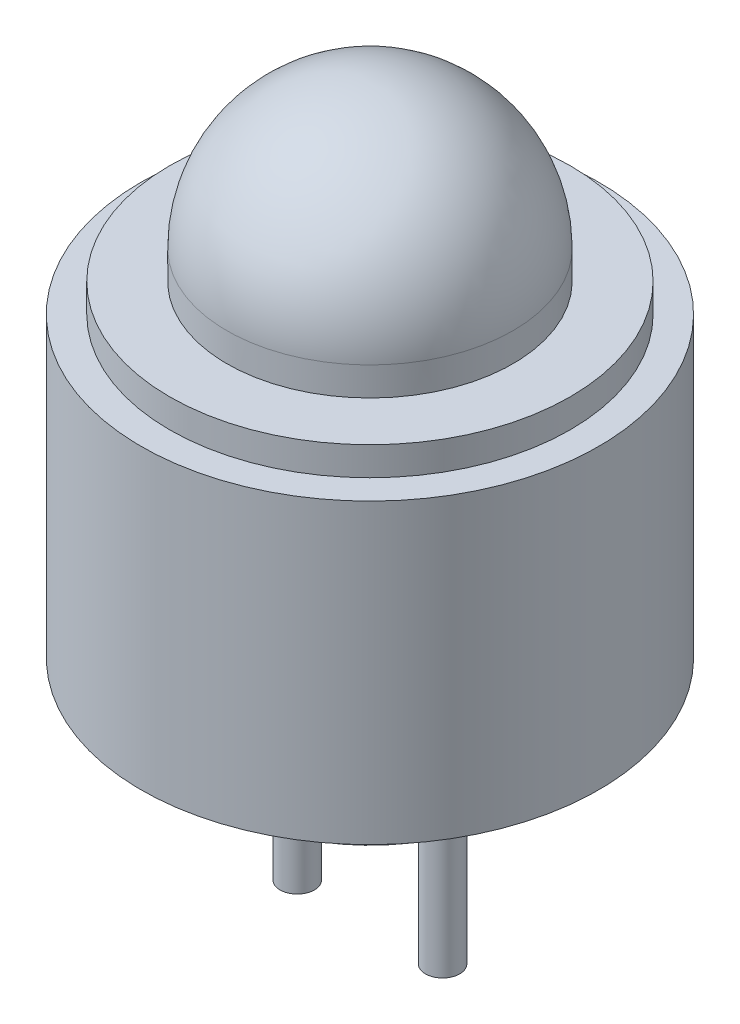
ISO-10303-21;
HEADER;
FILE_DESCRIPTION(('STEP AP214'),'2;1');
FILE_NAME('part.step','',(''),(''),'','','');
FILE_SCHEMA(('AUTOMOTIVE_DESIGN { 1 0 10303 214 1 1 1 1 }'));
ENDSEC;
DATA;
#1=APPLICATION_CONTEXT('core data for automotive mechanical design processes');
#2=APPLICATION_PROTOCOL_DEFINITION('international standard','automotive_design',2000,#1);
#3=PRODUCT_CONTEXT('',#1,'mechanical');
#4=PRODUCT('Part','Part','',(#3));
#5=PRODUCT_RELATED_PRODUCT_CATEGORY('part','',(#4));
#6=PRODUCT_DEFINITION_FORMATION('','',#4);
#7=PRODUCT_DEFINITION_CONTEXT('part definition',#1,'design');
#8=PRODUCT_DEFINITION('design','',#6,#7);
#9=PRODUCT_DEFINITION_SHAPE('','',#8);
#10=(LENGTH_UNIT() NAMED_UNIT(*) SI_UNIT(.MILLI.,.METRE.));
#11=(NAMED_UNIT(*) PLANE_ANGLE_UNIT() SI_UNIT($,.RADIAN.));
#12=(NAMED_UNIT(*) SI_UNIT($,.STERADIAN.) SOLID_ANGLE_UNIT());
#13=UNCERTAINTY_MEASURE_WITH_UNIT(LENGTH_MEASURE(1.E-05),#10,'distance_accuracy_value','');
#14=(GEOMETRIC_REPRESENTATION_CONTEXT(3) GLOBAL_UNCERTAINTY_ASSIGNED_CONTEXT((#13)) GLOBAL_UNIT_ASSIGNED_CONTEXT((#10,
#11,#12)) REPRESENTATION_CONTEXT('',''));
#15=CARTESIAN_POINT('',(0.,0.,0.));
#16=DIRECTION('',(0.,0.,1.));
#17=DIRECTION('',(1.,0.,0.));
#18=AXIS2_PLACEMENT_3D('',#15,#16,#17);
#19=CARTESIAN_POINT('',(0.,0.,0.));
#20=DIRECTION('',(0.,1.,0.));
#21=DIRECTION('',(-1.,0.,0.));
#22=AXIS2_PLACEMENT_3D('',#19,#20,#21);
#23=PLANE('',#22);
#24=CARTESIAN_POINT('',(-1.27,0.,0.));
#25=DIRECTION('',(0.,1.,0.));
#26=DIRECTION('',(-1.,0.,0.));
#27=AXIS2_PLACEMENT_3D('',#24,#25,#26);
#28=CIRCLE('',#27,0.3);
#29=CARTESIAN_POINT('',(-1.57,0.,0.));
#30=VERTEX_POINT('',#29);
#31=EDGE_CURVE('E38',#30,#30,#28,.F.);
#32=ORIENTED_EDGE('',*,*,#31,.F.);
#33=EDGE_LOOP('',(#32));
#34=FACE_BOUND('',#33,.T.);
#35=CARTESIAN_POINT('',(0.,0.,0.));
#36=DIRECTION('',(0.,1.,0.));
#37=DIRECTION('',(-1.,0.,0.));
#38=AXIS2_PLACEMENT_3D('',#35,#36,#37);
#39=CIRCLE('',#38,2.6);
#40=CARTESIAN_POINT('',(-2.6,0.,0.));
#41=VERTEX_POINT('',#40);
#42=EDGE_CURVE('E42',#41,#41,#39,.T.);
#43=ORIENTED_EDGE('',*,*,#42,.F.);
#44=EDGE_LOOP('',(#43));
#45=FACE_BOUND('',#44,.T.);
#46=CARTESIAN_POINT('',(1.27,0.,0.));
#47=DIRECTION('',(0.,1.,0.));
#48=DIRECTION('',(-1.,0.,0.));
#49=AXIS2_PLACEMENT_3D('',#46,#47,#48);
#50=CIRCLE('',#49,0.3);
#51=CARTESIAN_POINT('',(0.97,0.,0.));
#52=VERTEX_POINT('',#51);
#53=EDGE_CURVE('E10',#52,#52,#50,.F.);
#54=ORIENTED_EDGE('',*,*,#53,.F.);
#55=EDGE_LOOP('',(#54));
#56=FACE_BOUND('',#55,.T.);
#57=ADVANCED_FACE('F32',(#34,#45,#56),#23,.F.);
#58=CARTESIAN_POINT('',(0.,9.7,0.));
#59=DIRECTION('',(0.,1.,0.));
#60=DIRECTION('',(-1.,0.,0.));
#61=AXIS2_PLACEMENT_3D('',#58,#59,#60);
#62=CYLINDRICAL_SURFACE('',#61,2.6);
#63=CARTESIAN_POINT('',(0.,1.,0.));
#64=DIRECTION('',(0.,1.,0.));
#65=DIRECTION('',(-1.,0.,0.));
#66=AXIS2_PLACEMENT_3D('',#63,#64,#65);
#67=CIRCLE('',#66,2.6);
#68=CARTESIAN_POINT('',(-2.6,1.,0.));
#69=VERTEX_POINT('',#68);
#70=EDGE_CURVE('E46',#69,#69,#67,.T.);
#71=ORIENTED_EDGE('',*,*,#70,.F.);
#72=EDGE_LOOP('',(#71));
#73=FACE_BOUND('',#72,.T.);
#74=ORIENTED_EDGE('',*,*,#42,.T.);
#75=EDGE_LOOP('',(#74));
#76=FACE_BOUND('',#75,.T.);
#77=ADVANCED_FACE('F91',(#73,#76),#62,.T.);
#78=CARTESIAN_POINT('',(2.6,1.,0.));
#79=DIRECTION('',(0.,1.,0.));
#80=DIRECTION('',(-1.,0.,0.));
#81=AXIS2_PLACEMENT_3D('',#78,#79,#80);
#82=PLANE('',#81);
#83=CARTESIAN_POINT('',(0.,1.,0.));
#84=DIRECTION('',(0.,1.,0.));
#85=DIRECTION('',(-1.,0.,0.));
#86=AXIS2_PLACEMENT_3D('',#83,#84,#85);
#87=CIRCLE('',#86,4.);
#88=CARTESIAN_POINT('',(-4.,1.,0.));
#89=VERTEX_POINT('',#88);
#90=EDGE_CURVE('E51',#89,#89,#87,.T.);
#91=ORIENTED_EDGE('',*,*,#90,.F.);
#92=EDGE_LOOP('',(#91));
#93=FACE_BOUND('',#92,.T.);
#94=ORIENTED_EDGE('',*,*,#70,.T.);
#95=EDGE_LOOP('',(#94));
#96=FACE_BOUND('',#95,.T.);
#97=ADVANCED_FACE('F96',(#93,#96),#82,.F.);
#98=CARTESIAN_POINT('',(0.,9.7,0.));
#99=DIRECTION('',(0.,1.,0.));
#100=DIRECTION('',(-1.,0.,0.));
#101=AXIS2_PLACEMENT_3D('',#98,#99,#100);
#102=CYLINDRICAL_SURFACE('',#101,4.);
#103=CARTESIAN_POINT('',(0.,6.2,0.));
#104=DIRECTION('',(0.,1.,0.));
#105=DIRECTION('',(-1.,0.,0.));
#106=AXIS2_PLACEMENT_3D('',#103,#104,#105);
#107=CIRCLE('',#106,4.);
#108=CARTESIAN_POINT('',(-4.,6.2,0.));
#109=VERTEX_POINT('',#108);
#110=EDGE_CURVE('E54',#109,#109,#107,.T.);
#111=ORIENTED_EDGE('',*,*,#110,.F.);
#112=EDGE_LOOP('',(#111));
#113=FACE_BOUND('',#112,.T.);
#114=ORIENTED_EDGE('',*,*,#90,.T.);
#115=EDGE_LOOP('',(#114));
#116=FACE_BOUND('',#115,.T.);
#117=ADVANCED_FACE('F105',(#113,#116),#102,.T.);
#118=CARTESIAN_POINT('',(4.,6.2,0.));
#119=DIRECTION('',(0.,-1.,0.));
#120=DIRECTION('',(1.,0.,0.));
#121=AXIS2_PLACEMENT_3D('',#118,#119,#120);
#122=PLANE('',#121);
#123=CARTESIAN_POINT('',(0.,6.2,0.));
#124=DIRECTION('',(0.,1.,0.));
#125=DIRECTION('',(-1.,0.,0.));
#126=AXIS2_PLACEMENT_3D('',#123,#124,#125);
#127=CIRCLE('',#126,3.5);
#128=CARTESIAN_POINT('',(-3.5,6.2,0.));
#129=VERTEX_POINT('',#128);
#130=EDGE_CURVE('E57',#129,#129,#127,.T.);
#131=ORIENTED_EDGE('',*,*,#130,.F.);
#132=EDGE_LOOP('',(#131));
#133=FACE_BOUND('',#132,.T.);
#134=ORIENTED_EDGE('',*,*,#110,.T.);
#135=EDGE_LOOP('',(#134));
#136=FACE_BOUND('',#135,.T.);
#137=ADVANCED_FACE('F112',(#133,#136),#122,.F.);
#138=CARTESIAN_POINT('',(0.,9.7,0.));
#139=DIRECTION('',(0.,1.,0.));
#140=DIRECTION('',(-1.,0.,0.));
#141=AXIS2_PLACEMENT_3D('',#138,#139,#140);
#142=CYLINDRICAL_SURFACE('',#141,3.5);
#143=CARTESIAN_POINT('',(0.,6.7,0.));
#144=DIRECTION('',(0.,1.,0.));
#145=DIRECTION('',(-1.,0.,0.));
#146=AXIS2_PLACEMENT_3D('',#143,#144,#145);
#147=CIRCLE('',#146,3.5);
#148=CARTESIAN_POINT('',(-3.5,6.7,0.));
#149=VERTEX_POINT('',#148);
#150=EDGE_CURVE('E60',#149,#149,#147,.T.);
#151=ORIENTED_EDGE('',*,*,#150,.F.);
#152=EDGE_LOOP('',(#151));
#153=FACE_BOUND('',#152,.T.);
#154=ORIENTED_EDGE('',*,*,#130,.T.);
#155=EDGE_LOOP('',(#154));
#156=FACE_BOUND('',#155,.T.);
#157=ADVANCED_FACE('F116',(#153,#156),#142,.T.);
#158=CARTESIAN_POINT('',(3.5,6.7,0.));
#159=DIRECTION('',(0.,-1.,0.));
#160=DIRECTION('',(1.,0.,0.));
#161=AXIS2_PLACEMENT_3D('',#158,#159,#160);
#162=PLANE('',#161);
#163=CARTESIAN_POINT('',(0.,6.7,0.));
#164=DIRECTION('',(0.,1.,0.));
#165=DIRECTION('',(-1.,0.,0.));
#166=AXIS2_PLACEMENT_3D('',#163,#164,#165);
#167=CIRCLE('',#166,2.5);
#168=CARTESIAN_POINT('',(-2.5,6.7,0.));
#169=VERTEX_POINT('',#168);
#170=EDGE_CURVE('E63',#169,#169,#167,.T.);
#171=ORIENTED_EDGE('',*,*,#170,.F.);
#172=EDGE_LOOP('',(#171));
#173=FACE_BOUND('',#172,.T.);
#174=ORIENTED_EDGE('',*,*,#150,.T.);
#175=EDGE_LOOP('',(#174));
#176=FACE_BOUND('',#175,.T.);
#177=ADVANCED_FACE('F120',(#173,#176),#162,.F.);
#178=CARTESIAN_POINT('',(0.,9.7,0.));
#179=DIRECTION('',(0.,1.,0.));
#180=DIRECTION('',(-1.,0.,0.));
#181=AXIS2_PLACEMENT_3D('',#178,#179,#180);
#182=CYLINDRICAL_SURFACE('',#181,2.5);
#183=CARTESIAN_POINT('',(0.,7.2,0.));
#184=DIRECTION('',(0.,1.,0.));
#185=DIRECTION('',(-1.,0.,0.));
#186=AXIS2_PLACEMENT_3D('',#183,#184,#185);
#187=CIRCLE('',#186,2.5);
#188=CARTESIAN_POINT('',(-2.5,7.2,0.));
#189=VERTEX_POINT('',#188);
#190=EDGE_CURVE('E66',#189,#189,#187,.T.);
#191=ORIENTED_EDGE('',*,*,#190,.F.);
#192=EDGE_LOOP('',(#191));
#193=FACE_BOUND('',#192,.T.);
#194=ORIENTED_EDGE('',*,*,#170,.T.);
#195=EDGE_LOOP('',(#194));
#196=FACE_BOUND('',#195,.T.);
#197=ADVANCED_FACE('F124',(#193,#196),#182,.T.);
#198=CARTESIAN_POINT('',(0.,7.2,0.));
#199=DIRECTION('',(0.,1.,0.));
#200=DIRECTION('',(1.,0.,0.));
#201=AXIS2_PLACEMENT_3D('',#198,#199,#200);
#202=SPHERICAL_SURFACE('',#201,2.5);
#203=ORIENTED_EDGE('',*,*,#190,.T.);
#204=EDGE_LOOP('',(#203));
#205=FACE_BOUND('',#204,.T.);
#206=ADVANCED_FACE('F128',(#205),#202,.T.);
#207=CARTESIAN_POINT('',(-1.27,-3.,0.));
#208=DIRECTION('',(0.,1.,0.));
#209=DIRECTION('',(-1.,0.,0.));
#210=AXIS2_PLACEMENT_3D('',#207,#208,#209);
#211=CYLINDRICAL_SURFACE('',#210,0.3);
#212=CARTESIAN_POINT('',(-1.27,-3.,0.));
#213=DIRECTION('',(0.,-1.,0.));
#214=DIRECTION('',(1.,0.,0.));
#215=AXIS2_PLACEMENT_3D('',#212,#213,#214);
#216=CIRCLE('',#215,0.3);
#217=CARTESIAN_POINT('',(-0.97,-3.,0.));
#218=VERTEX_POINT('',#217);
#219=EDGE_CURVE('E69',#218,#218,#216,.T.);
#220=ORIENTED_EDGE('',*,*,#219,.F.);
#221=EDGE_LOOP('',(#220));
#222=FACE_BOUND('',#221,.T.);
#223=ORIENTED_EDGE('',*,*,#31,.T.);
#224=EDGE_LOOP('',(#223));
#225=FACE_BOUND('',#224,.T.);
#226=ADVANCED_FACE('F87',(#222,#225),#211,.T.);
#227=CARTESIAN_POINT('',(-1.27,-3.,0.));
#228=DIRECTION('',(0.,-1.,0.));
#229=DIRECTION('',(1.,0.,0.));
#230=AXIS2_PLACEMENT_3D('',#227,#228,#229);
#231=PLANE('',#230);
#232=ORIENTED_EDGE('',*,*,#219,.T.);
#233=EDGE_LOOP('',(#232));
#234=FACE_BOUND('',#233,.T.);
#235=ADVANCED_FACE('F80',(#234),#231,.T.);
#236=CARTESIAN_POINT('',(1.27,-3.,0.));
#237=DIRECTION('',(0.,1.,0.));
#238=DIRECTION('',(-1.,0.,0.));
#239=AXIS2_PLACEMENT_3D('',#236,#237,#238);
#240=CYLINDRICAL_SURFACE('',#239,0.3);
#241=CARTESIAN_POINT('',(1.27,-3.,0.));
#242=DIRECTION('',(0.,-1.,0.));
#243=DIRECTION('',(1.,0.,0.));
#244=AXIS2_PLACEMENT_3D('',#241,#242,#243);
#245=CIRCLE('',#244,0.3);
#246=CARTESIAN_POINT('',(1.57,-3.,0.));
#247=VERTEX_POINT('',#246);
#248=EDGE_CURVE('E72',#247,#247,#245,.T.);
#249=ORIENTED_EDGE('',*,*,#248,.F.);
#250=EDGE_LOOP('',(#249));
#251=FACE_BOUND('',#250,.T.);
#252=ORIENTED_EDGE('',*,*,#53,.T.);
#253=EDGE_LOOP('',(#252));
#254=FACE_BOUND('',#253,.T.);
#255=ADVANCED_FACE('F78',(#251,#254),#240,.T.);
#256=CARTESIAN_POINT('',(1.27,-3.,0.));
#257=DIRECTION('',(0.,-1.,0.));
#258=DIRECTION('',(1.,0.,0.));
#259=AXIS2_PLACEMENT_3D('',#256,#257,#258);
#260=PLANE('',#259);
#261=ORIENTED_EDGE('',*,*,#248,.T.);
#262=EDGE_LOOP('',(#261));
#263=FACE_BOUND('',#262,.T.);
#264=ADVANCED_FACE('F76',(#263),#260,.T.);
#265=CLOSED_SHELL('',(#57,#77,#97,#117,#137,#157,#177,#197,#206,#226,#235,#255,#264));
#266=MANIFOLD_SOLID_BREP('B2',#265);
#267=ADVANCED_BREP_SHAPE_REPRESENTATION('',(#18,#266),#14);
#268=SHAPE_DEFINITION_REPRESENTATION(#9,#267);
ENDSEC;
END-ISO-10303-21;
